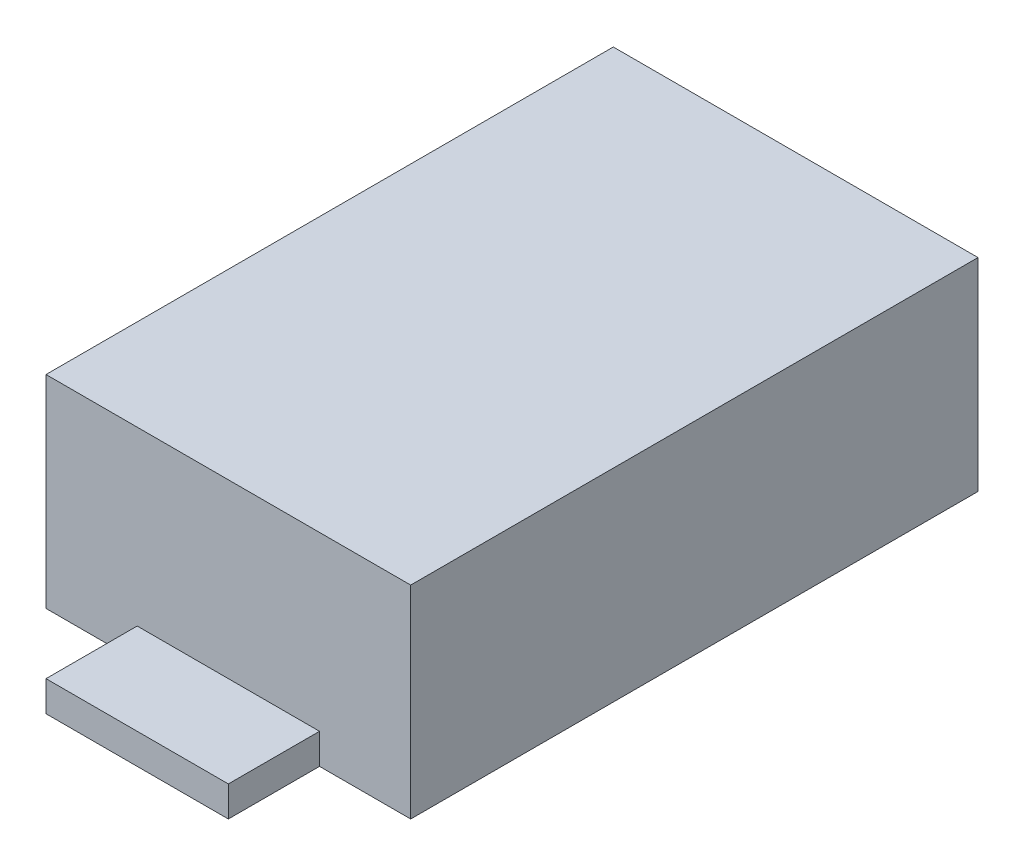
from build123d import *

# Parameters (mm, degrees)
BASES_W    = 1.8
BASES_H    = 2.8
BASE_DEPTH = 1
LEGS_W     = 0.9
LEGS_H     = 0.45
LEG_DEPTH  = 0.15


with BuildPart() as part:
    # BaseS → Base (new body)
    with BuildSketch(Plane(origin=(0, 0, 0), x_dir=(1, 0, 0), z_dir=(0, 1, 0))):
        Rectangle(BASES_W, BASES_H)
    extrude(amount=BASE_DEPTH)

    # LegS → Leg (add)
    with BuildSketch(Plane(origin=(0, 0, 0), x_dir=(1, 0, 0), z_dir=(0, 1, 0))):
        with Locations((0, 1.625)):
            Rectangle(LEGS_W, LEGS_H)
    leg = extrude(amount=LEG_DEPTH)

    # LVM: Leg across plane
    add(leg.mirror(Plane.XY))


solid = part.part
